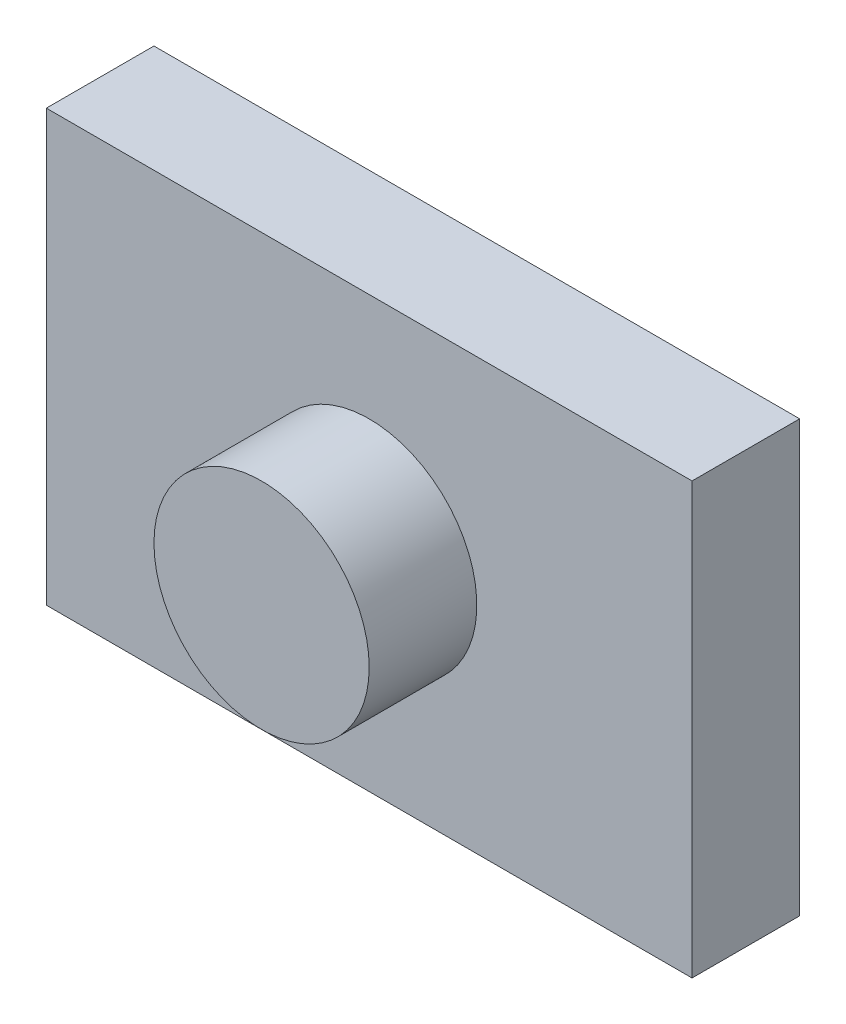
ISO-10303-21;
HEADER;
FILE_DESCRIPTION(('STEP AP214'),'2;1');
FILE_NAME('part.step','',(''),(''),'','','');
FILE_SCHEMA(('AUTOMOTIVE_DESIGN { 1 0 10303 214 1 1 1 1 }'));
ENDSEC;
DATA;
#1=APPLICATION_CONTEXT('core data for automotive mechanical design processes');
#2=APPLICATION_PROTOCOL_DEFINITION('international standard','automotive_design',2000,#1);
#3=PRODUCT_CONTEXT('',#1,'mechanical');
#4=PRODUCT('Part','Part','',(#3));
#5=PRODUCT_RELATED_PRODUCT_CATEGORY('part','',(#4));
#6=PRODUCT_DEFINITION_FORMATION('','',#4);
#7=PRODUCT_DEFINITION_CONTEXT('part definition',#1,'design');
#8=PRODUCT_DEFINITION('design','',#6,#7);
#9=PRODUCT_DEFINITION_SHAPE('','',#8);
#10=(LENGTH_UNIT() NAMED_UNIT(*) SI_UNIT(.MILLI.,.METRE.));
#11=(NAMED_UNIT(*) PLANE_ANGLE_UNIT() SI_UNIT($,.RADIAN.));
#12=(NAMED_UNIT(*) SI_UNIT($,.STERADIAN.) SOLID_ANGLE_UNIT());
#13=UNCERTAINTY_MEASURE_WITH_UNIT(LENGTH_MEASURE(1.E-05),#10,'distance_accuracy_value','');
#14=(GEOMETRIC_REPRESENTATION_CONTEXT(3) GLOBAL_UNCERTAINTY_ASSIGNED_CONTEXT((#13)) GLOBAL_UNIT_ASSIGNED_CONTEXT((#10,
#11,#12)) REPRESENTATION_CONTEXT('',''));
#15=CARTESIAN_POINT('',(0.,0.,0.));
#16=DIRECTION('',(0.,0.,1.));
#17=DIRECTION('',(1.,0.,0.));
#18=AXIS2_PLACEMENT_3D('',#15,#16,#17);
#19=CARTESIAN_POINT('',(0.,40.,5.));
#20=DIRECTION('',(0.,0.,-1.));
#21=DIRECTION('',(-1.,0.,0.));
#22=AXIS2_PLACEMENT_3D('',#19,#20,#21);
#23=PLANE('',#22);
#24=DIRECTION('',(0.,-1.,0.));
#25=VECTOR('',#24,1.);
#26=CARTESIAN_POINT('',(0.,0.,5.));
#27=LINE('',#26,#25);
#28=CARTESIAN_POINT('',(0.,40.,5.));
#29=VERTEX_POINT('',#28);
#30=CARTESIAN_POINT('',(0.,0.,5.));
#31=VERTEX_POINT('',#30);
#32=EDGE_CURVE('E104',#29,#31,#27,.T.);
#33=ORIENTED_EDGE('',*,*,#32,.T.);
#34=DIRECTION('',(1.,0.,0.));
#35=VECTOR('',#34,1.);
#36=CARTESIAN_POINT('',(0.,0.,5.));
#37=LINE('',#36,#35);
#38=CARTESIAN_POINT('',(60.,0.,5.));
#39=VERTEX_POINT('',#38);
#40=EDGE_CURVE('E90',#31,#39,#37,.T.);
#41=ORIENTED_EDGE('',*,*,#40,.T.);
#42=DIRECTION('',(0.,1.,0.));
#43=VECTOR('',#42,1.);
#44=CARTESIAN_POINT('',(60.,0.,5.));
#45=LINE('',#44,#43);
#46=CARTESIAN_POINT('',(60.,40.,5.));
#47=VERTEX_POINT('',#46);
#48=EDGE_CURVE('E55',#39,#47,#45,.T.);
#49=ORIENTED_EDGE('',*,*,#48,.T.);
#50=DIRECTION('',(-1.,0.,0.));
#51=VECTOR('',#50,1.);
#52=CARTESIAN_POINT('',(0.,40.,5.));
#53=LINE('',#52,#51);
#54=EDGE_CURVE('E50',#47,#29,#53,.T.);
#55=ORIENTED_EDGE('',*,*,#54,.T.);
#56=EDGE_LOOP('',(#33,#41,#49,#55));
#57=FACE_BOUND('',#56,.T.);
#58=CARTESIAN_POINT('',(30.,20.,5.));
#59=DIRECTION('',(0.,0.,-1.));
#60=DIRECTION('',(-1.,0.,0.));
#61=AXIS2_PLACEMENT_3D('',#58,#59,#60);
#62=CIRCLE('',#61,10.);
#63=CARTESIAN_POINT('',(20.,20.,5.));
#64=VERTEX_POINT('',#63);
#65=EDGE_CURVE('E11',#64,#64,#62,.F.);
#66=ORIENTED_EDGE('',*,*,#65,.F.);
#67=EDGE_LOOP('',(#66));
#68=FACE_BOUND('',#67,.T.);
#69=ADVANCED_FACE('F33',(#57,#68),#23,.F.);
#70=CARTESIAN_POINT('',(0.,40.,-5.));
#71=DIRECTION('',(0.,0.,-1.));
#72=DIRECTION('',(-1.,0.,0.));
#73=AXIS2_PLACEMENT_3D('',#70,#71,#72);
#74=PLANE('',#73);
#75=DIRECTION('',(0.,-1.,0.));
#76=VECTOR('',#75,1.);
#77=CARTESIAN_POINT('',(0.,0.,-5.));
#78=LINE('',#77,#76);
#79=CARTESIAN_POINT('',(0.,40.,-5.));
#80=VERTEX_POINT('',#79);
#81=CARTESIAN_POINT('',(0.,0.,-5.));
#82=VERTEX_POINT('',#81);
#83=EDGE_CURVE('E82',#80,#82,#78,.T.);
#84=ORIENTED_EDGE('',*,*,#83,.F.);
#85=DIRECTION('',(-1.,0.,0.));
#86=VECTOR('',#85,1.);
#87=CARTESIAN_POINT('',(0.,40.,-5.));
#88=LINE('',#87,#86);
#89=CARTESIAN_POINT('',(60.,40.,-5.));
#90=VERTEX_POINT('',#89);
#91=EDGE_CURVE('E102',#90,#80,#88,.T.);
#92=ORIENTED_EDGE('',*,*,#91,.F.);
#93=DIRECTION('',(0.,1.,0.));
#94=VECTOR('',#93,1.);
#95=CARTESIAN_POINT('',(60.,0.,-5.));
#96=LINE('',#95,#94);
#97=CARTESIAN_POINT('',(60.,0.,-5.));
#98=VERTEX_POINT('',#97);
#99=EDGE_CURVE('E83',#98,#90,#96,.T.);
#100=ORIENTED_EDGE('',*,*,#99,.F.);
#101=DIRECTION('',(1.,0.,0.));
#102=VECTOR('',#101,1.);
#103=CARTESIAN_POINT('',(0.,0.,-5.));
#104=LINE('',#103,#102);
#105=EDGE_CURVE('E76',#82,#98,#104,.T.);
#106=ORIENTED_EDGE('',*,*,#105,.F.);
#107=EDGE_LOOP('',(#84,#92,#100,#106));
#108=FACE_BOUND('',#107,.T.);
#109=CARTESIAN_POINT('',(30.,20.,-5.));
#110=DIRECTION('',(0.,0.,-1.));
#111=DIRECTION('',(-1.,0.,0.));
#112=AXIS2_PLACEMENT_3D('',#109,#110,#111);
#113=CIRCLE('',#112,10.);
#114=CARTESIAN_POINT('',(20.,20.,-5.));
#115=VERTEX_POINT('',#114);
#116=EDGE_CURVE('E37',#115,#115,#113,.F.);
#117=ORIENTED_EDGE('',*,*,#116,.T.);
#118=EDGE_LOOP('',(#117));
#119=FACE_BOUND('',#118,.T.);
#120=ADVANCED_FACE('F78',(#108,#119),#74,.T.);
#121=CARTESIAN_POINT('',(0.,0.,5.));
#122=DIRECTION('',(1.,0.,0.));
#123=DIRECTION('',(0.,0.,-1.));
#124=AXIS2_PLACEMENT_3D('',#121,#122,#123);
#125=PLANE('',#124);
#126=ORIENTED_EDGE('',*,*,#83,.T.);
#127=DIRECTION('',(0.,0.,-1.));
#128=VECTOR('',#127,1.);
#129=CARTESIAN_POINT('',(0.,0.,5.));
#130=LINE('',#129,#128);
#131=EDGE_CURVE('E42',#31,#82,#130,.T.);
#132=ORIENTED_EDGE('',*,*,#131,.F.);
#133=ORIENTED_EDGE('',*,*,#32,.F.);
#134=DIRECTION('',(0.,0.,-1.));
#135=VECTOR('',#134,1.);
#136=CARTESIAN_POINT('',(0.,40.,5.));
#137=LINE('',#136,#135);
#138=EDGE_CURVE('E95',#29,#80,#137,.T.);
#139=ORIENTED_EDGE('',*,*,#138,.T.);
#140=EDGE_LOOP('',(#126,#132,#133,#139));
#141=FACE_BOUND('',#140,.T.);
#142=ADVANCED_FACE('F35',(#141),#125,.F.);
#143=CARTESIAN_POINT('',(0.,0.,5.));
#144=DIRECTION('',(0.,1.,0.));
#145=DIRECTION('',(0.,0.,1.));
#146=AXIS2_PLACEMENT_3D('',#143,#144,#145);
#147=PLANE('',#146);
#148=ORIENTED_EDGE('',*,*,#105,.T.);
#149=DIRECTION('',(0.,0.,-1.));
#150=VECTOR('',#149,1.);
#151=CARTESIAN_POINT('',(60.,0.,5.));
#152=LINE('',#151,#150);
#153=EDGE_CURVE('E93',#39,#98,#152,.T.);
#154=ORIENTED_EDGE('',*,*,#153,.F.);
#155=ORIENTED_EDGE('',*,*,#40,.F.);
#156=ORIENTED_EDGE('',*,*,#131,.T.);
#157=EDGE_LOOP('',(#148,#154,#155,#156));
#158=FACE_BOUND('',#157,.T.);
#159=ADVANCED_FACE('F89',(#158),#147,.F.);
#160=CARTESIAN_POINT('',(60.,0.,5.));
#161=DIRECTION('',(-1.,0.,0.));
#162=DIRECTION('',(0.,0.,1.));
#163=AXIS2_PLACEMENT_3D('',#160,#161,#162);
#164=PLANE('',#163);
#165=ORIENTED_EDGE('',*,*,#99,.T.);
#166=DIRECTION('',(0.,0.,-1.));
#167=VECTOR('',#166,1.);
#168=CARTESIAN_POINT('',(60.,40.,5.));
#169=LINE('',#168,#167);
#170=EDGE_CURVE('E110',#47,#90,#169,.T.);
#171=ORIENTED_EDGE('',*,*,#170,.F.);
#172=ORIENTED_EDGE('',*,*,#48,.F.);
#173=ORIENTED_EDGE('',*,*,#153,.T.);
#174=EDGE_LOOP('',(#165,#171,#172,#173));
#175=FACE_BOUND('',#174,.T.);
#176=ADVANCED_FACE('F114',(#175),#164,.F.);
#177=CARTESIAN_POINT('',(0.,40.,5.));
#178=DIRECTION('',(0.,-1.,0.));
#179=DIRECTION('',(0.,0.,-1.));
#180=AXIS2_PLACEMENT_3D('',#177,#178,#179);
#181=PLANE('',#180);
#182=ORIENTED_EDGE('',*,*,#91,.T.);
#183=ORIENTED_EDGE('',*,*,#138,.F.);
#184=ORIENTED_EDGE('',*,*,#54,.F.);
#185=ORIENTED_EDGE('',*,*,#170,.T.);
#186=EDGE_LOOP('',(#182,#183,#184,#185));
#187=FACE_BOUND('',#186,.T.);
#188=ADVANCED_FACE('F116',(#187),#181,.F.);
#189=CARTESIAN_POINT('',(30.,20.,-15.));
#190=DIRECTION('',(0.,0.,1.));
#191=DIRECTION('',(1.,0.,0.));
#192=AXIS2_PLACEMENT_3D('',#189,#190,#191);
#193=PLANE('',#192);
#194=CARTESIAN_POINT('',(30.,20.,-15.));
#195=DIRECTION('',(0.,0.,1.));
#196=DIRECTION('',(1.,0.,0.));
#197=AXIS2_PLACEMENT_3D('',#194,#195,#196);
#198=CIRCLE('',#197,10.);
#199=CARTESIAN_POINT('',(40.,20.,-15.));
#200=VERTEX_POINT('',#199);
#201=EDGE_CURVE('E206',#200,#200,#198,.T.);
#202=ORIENTED_EDGE('',*,*,#201,.F.);
#203=EDGE_LOOP('',(#202));
#204=FACE_BOUND('',#203,.T.);
#205=ADVANCED_FACE('F134',(#204),#193,.F.);
#206=CARTESIAN_POINT('',(30.,20.,15.));
#207=DIRECTION('',(0.,0.,-1.));
#208=DIRECTION('',(-1.,0.,0.));
#209=AXIS2_PLACEMENT_3D('',#206,#207,#208);
#210=CYLINDRICAL_SURFACE('',#209,10.);
#211=ORIENTED_EDGE('',*,*,#116,.F.);
#212=EDGE_LOOP('',(#211));
#213=FACE_BOUND('',#212,.T.);
#214=ORIENTED_EDGE('',*,*,#201,.T.);
#215=EDGE_LOOP('',(#214));
#216=FACE_BOUND('',#215,.T.);
#217=ADVANCED_FACE('F125',(#213,#216),#210,.T.);
#218=CARTESIAN_POINT('',(30.,20.,15.));
#219=DIRECTION('',(0.,0.,1.));
#220=DIRECTION('',(1.,0.,0.));
#221=AXIS2_PLACEMENT_3D('',#218,#219,#220);
#222=CIRCLE('',#221,10.);
#223=CARTESIAN_POINT('',(40.,20.,15.));
#224=VERTEX_POINT('',#223);
#225=EDGE_CURVE('E98',#224,#224,#222,.T.);
#226=ORIENTED_EDGE('',*,*,#225,.F.);
#227=EDGE_LOOP('',(#226));
#228=FACE_BOUND('',#227,.T.);
#229=ORIENTED_EDGE('',*,*,#65,.T.);
#230=EDGE_LOOP('',(#229));
#231=FACE_BOUND('',#230,.T.);
#232=ADVANCED_FACE('F122',(#228,#231),#210,.T.);
#233=CARTESIAN_POINT('',(30.,20.,15.));
#234=DIRECTION('',(0.,0.,1.));
#235=DIRECTION('',(1.,0.,0.));
#236=AXIS2_PLACEMENT_3D('',#233,#234,#235);
#237=PLANE('',#236);
#238=ORIENTED_EDGE('',*,*,#225,.T.);
#239=EDGE_LOOP('',(#238));
#240=FACE_BOUND('',#239,.T.);
#241=ADVANCED_FACE('F124',(#240),#237,.T.);
#242=CLOSED_SHELL('',(#69,#120,#142,#159,#176,#188,#205,#217,#232,#241));
#243=MANIFOLD_SOLID_BREP('B2',#242);
#244=ADVANCED_BREP_SHAPE_REPRESENTATION('',(#18,#243),#14);
#245=SHAPE_DEFINITION_REPRESENTATION(#9,#244);
ENDSEC;
END-ISO-10303-21;
